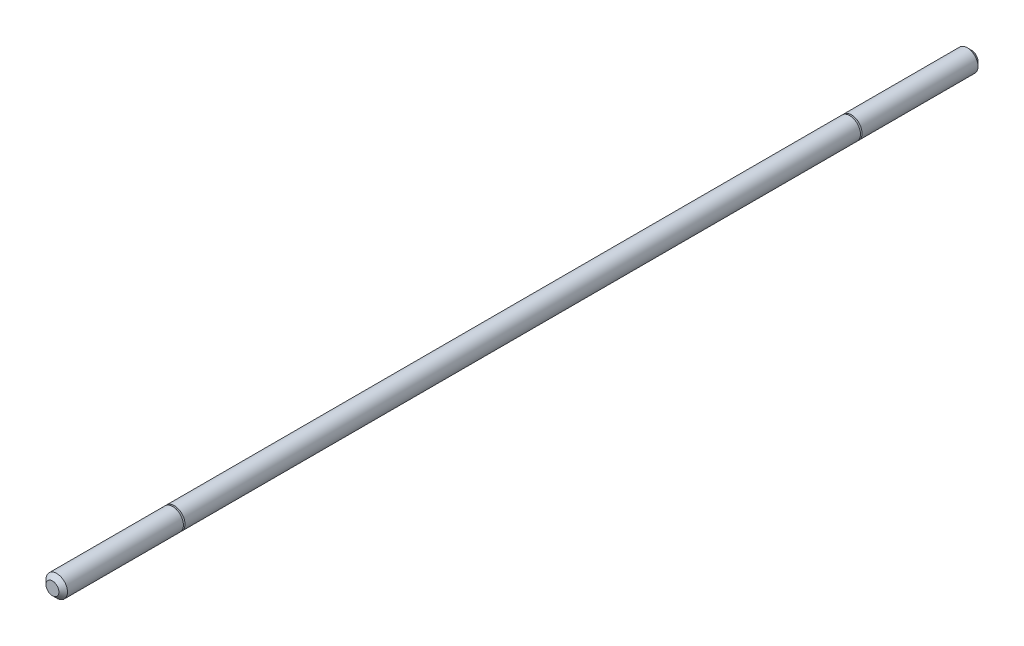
ISO-10303-21;
HEADER;
FILE_DESCRIPTION(('STEP AP214'),'2;1');
FILE_NAME('part.step','',(''),(''),'','','');
FILE_SCHEMA(('AUTOMOTIVE_DESIGN { 1 0 10303 214 1 1 1 1 }'));
ENDSEC;
DATA;
#1=APPLICATION_CONTEXT('core data for automotive mechanical design processes');
#2=APPLICATION_PROTOCOL_DEFINITION('international standard','automotive_design',2000,#1);
#3=PRODUCT_CONTEXT('',#1,'mechanical');
#4=PRODUCT('Part','Part','',(#3));
#5=PRODUCT_RELATED_PRODUCT_CATEGORY('part','',(#4));
#6=PRODUCT_DEFINITION_FORMATION('','',#4);
#7=PRODUCT_DEFINITION_CONTEXT('part definition',#1,'design');
#8=PRODUCT_DEFINITION('design','',#6,#7);
#9=PRODUCT_DEFINITION_SHAPE('','',#8);
#10=(LENGTH_UNIT() NAMED_UNIT(*) SI_UNIT(.MILLI.,.METRE.));
#11=(NAMED_UNIT(*) PLANE_ANGLE_UNIT() SI_UNIT($,.RADIAN.));
#12=(NAMED_UNIT(*) SI_UNIT($,.STERADIAN.) SOLID_ANGLE_UNIT());
#13=UNCERTAINTY_MEASURE_WITH_UNIT(LENGTH_MEASURE(1.E-05),#10,'distance_accuracy_value','');
#14=(GEOMETRIC_REPRESENTATION_CONTEXT(3) GLOBAL_UNCERTAINTY_ASSIGNED_CONTEXT((#13)) GLOBAL_UNIT_ASSIGNED_CONTEXT((#10,
#11,#12)) REPRESENTATION_CONTEXT('',''));
#15=CARTESIAN_POINT('',(0.,0.,0.));
#16=DIRECTION('',(0.,0.,1.));
#17=DIRECTION('',(1.,0.,0.));
#18=AXIS2_PLACEMENT_3D('',#15,#16,#17);
#19=CARTESIAN_POINT('',(0.,0.,339.725));
#20=DIRECTION('',(0.,0.,-1.));
#21=DIRECTION('',(-1.,0.,0.));
#22=AXIS2_PLACEMENT_3D('',#19,#20,#21);
#23=CYLINDRICAL_SURFACE('',#22,7.9375);
#24=CARTESIAN_POINT('',(0.,0.,249.6566));
#25=DIRECTION('',(0.,0.,1.));
#26=DIRECTION('',(1.,0.,0.));
#27=AXIS2_PLACEMENT_3D('',#24,#25,#26);
#28=CIRCLE('',#27,7.9375);
#29=CARTESIAN_POINT('',(7.9375,0.,249.6566));
#30=VERTEX_POINT('',#29);
#31=EDGE_CURVE('E56',#30,#30,#28,.T.);
#32=ORIENTED_EDGE('',*,*,#31,.F.);
#33=EDGE_LOOP('',(#32));
#34=FACE_BOUND('',#33,.T.);
#35=CARTESIAN_POINT('',(0.,0.,-249.6566));
#36=DIRECTION('',(0.,0.,-1.));
#37=DIRECTION('',(-1.,0.,0.));
#38=AXIS2_PLACEMENT_3D('',#35,#36,#37);
#39=CIRCLE('',#38,7.9375);
#40=CARTESIAN_POINT('',(-7.9375,0.,-249.6566));
#41=VERTEX_POINT('',#40);
#42=EDGE_CURVE('E40',#41,#41,#39,.T.);
#43=ORIENTED_EDGE('',*,*,#42,.F.);
#44=EDGE_LOOP('',(#43));
#45=FACE_BOUND('',#44,.T.);
#46=ADVANCED_FACE('F36',(#34,#45),#23,.T.);
#47=CARTESIAN_POINT('',(0.,0.,249.6566));
#48=DIRECTION('',(0.,0.,1.));
#49=DIRECTION('',(1.,0.,0.));
#50=AXIS2_PLACEMENT_3D('',#47,#48,#49);
#51=PLANE('',#50);
#52=CARTESIAN_POINT('',(0.,0.,249.6566));
#53=DIRECTION('',(0.,0.,1.));
#54=DIRECTION('',(1.,0.,0.));
#55=AXIS2_PLACEMENT_3D('',#52,#53,#54);
#56=CIRCLE('',#55,6.1595);
#57=CARTESIAN_POINT('',(6.1595,0.,249.6566));
#58=VERTEX_POINT('',#57);
#59=EDGE_CURVE('E57',#58,#58,#56,.T.);
#60=ORIENTED_EDGE('',*,*,#59,.F.);
#61=EDGE_LOOP('',(#60));
#62=FACE_BOUND('',#61,.T.);
#63=ORIENTED_EDGE('',*,*,#31,.T.);
#64=EDGE_LOOP('',(#63));
#65=FACE_BOUND('',#64,.T.);
#66=ADVANCED_FACE('F100',(#62,#65),#51,.T.);
#67=CARTESIAN_POINT('',(0.,0.,250.825));
#68=DIRECTION('',(0.,0.,1.));
#69=DIRECTION('',(1.,0.,0.));
#70=AXIS2_PLACEMENT_3D('',#67,#68,#69);
#71=PLANE('',#70);
#72=CARTESIAN_POINT('',(0.,0.,250.825));
#73=DIRECTION('',(0.,0.,1.));
#74=DIRECTION('',(1.,0.,0.));
#75=AXIS2_PLACEMENT_3D('',#72,#73,#74);
#76=CIRCLE('',#75,6.1595);
#77=CARTESIAN_POINT('',(6.1595,0.,250.825));
#78=VERTEX_POINT('',#77);
#79=EDGE_CURVE('E66',#78,#78,#76,.T.);
#80=ORIENTED_EDGE('',*,*,#79,.T.);
#81=EDGE_LOOP('',(#80));
#82=FACE_BOUND('',#81,.T.);
#83=CARTESIAN_POINT('',(0.,0.,250.825));
#84=DIRECTION('',(0.,0.,1.));
#85=DIRECTION('',(1.,0.,0.));
#86=AXIS2_PLACEMENT_3D('',#83,#84,#85);
#87=CIRCLE('',#86,7.9375);
#88=CARTESIAN_POINT('',(7.9375,0.,250.825));
#89=VERTEX_POINT('',#88);
#90=EDGE_CURVE('E53',#89,#89,#87,.T.);
#91=ORIENTED_EDGE('',*,*,#90,.F.);
#92=EDGE_LOOP('',(#91));
#93=FACE_BOUND('',#92,.T.);
#94=ADVANCED_FACE('F105',(#82,#93),#71,.F.);
#95=CARTESIAN_POINT('',(0.,0.,249.6566));
#96=DIRECTION('',(0.,0.,1.));
#97=DIRECTION('',(1.,0.,0.));
#98=AXIS2_PLACEMENT_3D('',#95,#96,#97);
#99=CYLINDRICAL_SURFACE('',#98,6.1595);
#100=ORIENTED_EDGE('',*,*,#59,.T.);
#101=EDGE_LOOP('',(#100));
#102=FACE_BOUND('',#101,.T.);
#103=ORIENTED_EDGE('',*,*,#79,.F.);
#104=EDGE_LOOP('',(#103));
#105=FACE_BOUND('',#104,.T.);
#106=ADVANCED_FACE('F127',(#102,#105),#99,.T.);
#107=CARTESIAN_POINT('',(0.,0.,339.725));
#108=DIRECTION('',(0.,0.,1.));
#109=DIRECTION('',(1.,0.,0.));
#110=AXIS2_PLACEMENT_3D('',#107,#108,#109);
#111=PLANE('',#110);
#112=CARTESIAN_POINT('',(0.,0.,339.725));
#113=DIRECTION('',(0.,0.,1.));
#114=DIRECTION('',(1.,0.,0.));
#115=AXIS2_PLACEMENT_3D('',#112,#113,#114);
#116=CIRCLE('',#115,4.76250000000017);
#117=CARTESIAN_POINT('',(4.76250000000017,0.,339.725));
#118=VERTEX_POINT('',#117);
#119=EDGE_CURVE('E11',#118,#118,#116,.T.);
#120=ORIENTED_EDGE('',*,*,#119,.T.);
#121=EDGE_LOOP('',(#120));
#122=FACE_BOUND('',#121,.T.);
#123=ADVANCED_FACE('F119',(#122),#111,.T.);
#124=CARTESIAN_POINT('',(0.,0.,339.725));
#125=DIRECTION('',(0.,0.,-1.));
#126=DIRECTION('',(-1.,0.,0.));
#127=AXIS2_PLACEMENT_3D('',#124,#125,#126);
#128=CONICAL_SURFACE('',#127,4.76250000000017,0.785398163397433);
#129=CARTESIAN_POINT('',(0.,0.,336.55));
#130=DIRECTION('',(0.,0.,1.));
#131=DIRECTION('',(1.,0.,0.));
#132=AXIS2_PLACEMENT_3D('',#129,#130,#131);
#133=CIRCLE('',#132,7.9375);
#134=CARTESIAN_POINT('',(7.9375,0.,336.55));
#135=VERTEX_POINT('',#134);
#136=EDGE_CURVE('E59',#135,#135,#133,.F.);
#137=ORIENTED_EDGE('',*,*,#136,.F.);
#138=EDGE_LOOP('',(#137));
#139=FACE_BOUND('',#138,.T.);
#140=ORIENTED_EDGE('',*,*,#119,.F.);
#141=EDGE_LOOP('',(#140));
#142=FACE_BOUND('',#141,.T.);
#143=ADVANCED_FACE('F38',(#139,#142),#128,.T.);
#144=ORIENTED_EDGE('',*,*,#90,.T.);
#145=EDGE_LOOP('',(#144));
#146=FACE_BOUND('',#145,.T.);
#147=ORIENTED_EDGE('',*,*,#136,.T.);
#148=EDGE_LOOP('',(#147));
#149=FACE_BOUND('',#148,.T.);
#150=ADVANCED_FACE('F94',(#146,#149),#23,.T.);
#151=CARTESIAN_POINT('',(0.,0.,-249.6566));
#152=DIRECTION('',(0.,0.,-1.));
#153=DIRECTION('',(-1.,0.,0.));
#154=AXIS2_PLACEMENT_3D('',#151,#152,#153);
#155=PLANE('',#154);
#156=CARTESIAN_POINT('',(0.,0.,-249.6566));
#157=DIRECTION('',(0.,0.,1.));
#158=DIRECTION('',(1.,0.,0.));
#159=AXIS2_PLACEMENT_3D('',#156,#157,#158);
#160=CIRCLE('',#159,6.1595);
#161=CARTESIAN_POINT('',(6.1595,0.,-249.6566));
#162=VERTEX_POINT('',#161);
#163=EDGE_CURVE('E62',#162,#162,#160,.T.);
#164=ORIENTED_EDGE('',*,*,#163,.T.);
#165=EDGE_LOOP('',(#164));
#166=FACE_BOUND('',#165,.T.);
#167=ORIENTED_EDGE('',*,*,#42,.T.);
#168=EDGE_LOOP('',(#167));
#169=FACE_BOUND('',#168,.T.);
#170=ADVANCED_FACE('F111',(#166,#169),#155,.T.);
#171=CARTESIAN_POINT('',(0.,0.,-250.825));
#172=DIRECTION('',(0.,0.,-1.));
#173=DIRECTION('',(-1.,0.,0.));
#174=AXIS2_PLACEMENT_3D('',#171,#172,#173);
#175=PLANE('',#174);
#176=CARTESIAN_POINT('',(0.,0.,-250.825));
#177=DIRECTION('',(0.,0.,1.));
#178=DIRECTION('',(1.,0.,0.));
#179=AXIS2_PLACEMENT_3D('',#176,#177,#178);
#180=CIRCLE('',#179,6.1595);
#181=CARTESIAN_POINT('',(6.1595,0.,-250.825));
#182=VERTEX_POINT('',#181);
#183=EDGE_CURVE('E68',#182,#182,#180,.T.);
#184=ORIENTED_EDGE('',*,*,#183,.F.);
#185=EDGE_LOOP('',(#184));
#186=FACE_BOUND('',#185,.T.);
#187=CARTESIAN_POINT('',(0.,0.,-250.825));
#188=DIRECTION('',(0.,0.,-1.));
#189=DIRECTION('',(-1.,0.,0.));
#190=AXIS2_PLACEMENT_3D('',#187,#188,#189);
#191=CIRCLE('',#190,7.9375);
#192=CARTESIAN_POINT('',(-7.9375,0.,-250.825));
#193=VERTEX_POINT('',#192);
#194=EDGE_CURVE('E60',#193,#193,#191,.T.);
#195=ORIENTED_EDGE('',*,*,#194,.F.);
#196=EDGE_LOOP('',(#195));
#197=FACE_BOUND('',#196,.T.);
#198=ADVANCED_FACE('F117',(#186,#197),#175,.F.);
#199=CARTESIAN_POINT('',(0.,0.,-249.6566));
#200=DIRECTION('',(0.,0.,-1.));
#201=DIRECTION('',(-1.,0.,0.));
#202=AXIS2_PLACEMENT_3D('',#199,#200,#201);
#203=CYLINDRICAL_SURFACE('',#202,6.1595);
#204=ORIENTED_EDGE('',*,*,#163,.F.);
#205=EDGE_LOOP('',(#204));
#206=FACE_BOUND('',#205,.T.);
#207=ORIENTED_EDGE('',*,*,#183,.T.);
#208=EDGE_LOOP('',(#207));
#209=FACE_BOUND('',#208,.T.);
#210=ADVANCED_FACE('F95',(#206,#209),#203,.T.);
#211=CARTESIAN_POINT('',(0.,0.,-339.725));
#212=DIRECTION('',(0.,0.,1.));
#213=DIRECTION('',(1.,0.,0.));
#214=AXIS2_PLACEMENT_3D('',#211,#212,#213);
#215=PLANE('',#214);
#216=CARTESIAN_POINT('',(0.,0.,-339.725));
#217=DIRECTION('',(0.,0.,1.));
#218=DIRECTION('',(1.,0.,0.));
#219=AXIS2_PLACEMENT_3D('',#216,#217,#218);
#220=CIRCLE('',#219,4.76249999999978);
#221=CARTESIAN_POINT('',(4.76249999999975,0.,-339.725));
#222=VERTEX_POINT('',#221);
#223=EDGE_CURVE('E44',#222,#222,#220,.F.);
#224=ORIENTED_EDGE('',*,*,#223,.T.);
#225=EDGE_LOOP('',(#224));
#226=FACE_BOUND('',#225,.T.);
#227=ADVANCED_FACE('F87',(#226),#215,.F.);
#228=CARTESIAN_POINT('',(0.,0.,-336.55));
#229=DIRECTION('',(0.,0.,1.));
#230=DIRECTION('',(1.,0.,0.));
#231=AXIS2_PLACEMENT_3D('',#228,#229,#230);
#232=CONICAL_SURFACE('',#231,7.9375,0.785398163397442);
#233=CARTESIAN_POINT('',(0.,0.,-336.55));
#234=DIRECTION('',(0.,0.,1.));
#235=DIRECTION('',(1.,0.,0.));
#236=AXIS2_PLACEMENT_3D('',#233,#234,#235);
#237=CIRCLE('',#236,7.9375);
#238=CARTESIAN_POINT('',(7.93749999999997,0.,-336.55));
#239=VERTEX_POINT('',#238);
#240=EDGE_CURVE('E49',#239,#239,#237,.T.);
#241=CARTESIAN_POINT('',(4.76249999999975,0.,-339.725));
#242=CARTESIAN_POINT('',(4.79557291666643,0.,-339.691927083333));
#243=CARTESIAN_POINT('',(4.8286458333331,0.,-339.658854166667));
#244=CARTESIAN_POINT('',(4.89479166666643,0.,-339.592708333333));
#245=CARTESIAN_POINT('',(4.9278645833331,0.,-339.559635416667));
#246=CARTESIAN_POINT('',(4.99401041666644,0.,-339.493489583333));
#247=CARTESIAN_POINT('',(5.02708333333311,0.,-339.460416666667));
#248=CARTESIAN_POINT('',(5.09322916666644,0.,-339.394270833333));
#249=CARTESIAN_POINT('',(5.12630208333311,0.,-339.361197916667));
#250=CARTESIAN_POINT('',(5.19244791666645,0.,-339.295052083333));
#251=CARTESIAN_POINT('',(5.22552083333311,0.,-339.261979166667));
#252=CARTESIAN_POINT('',(5.29166666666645,0.,-339.195833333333));
#253=CARTESIAN_POINT('',(5.32473958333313,0.,-339.162760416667));
#254=CARTESIAN_POINT('',(5.39088541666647,0.,-339.096614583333));
#255=CARTESIAN_POINT('',(5.42395833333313,0.,-339.063541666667));
#256=CARTESIAN_POINT('',(5.49010416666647,0.,-338.997395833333));
#257=CARTESIAN_POINT('',(5.52317708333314,0.,-338.964322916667));
#258=CARTESIAN_POINT('',(5.58932291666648,0.,-338.898177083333));
#259=CARTESIAN_POINT('',(5.62239583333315,0.,-338.865104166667));
#260=CARTESIAN_POINT('',(5.68854166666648,0.,-338.798958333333));
#261=CARTESIAN_POINT('',(5.72161458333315,0.,-338.765885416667));
#262=CARTESIAN_POINT('',(5.78776041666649,0.,-338.699739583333));
#263=CARTESIAN_POINT('',(5.82083333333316,0.,-338.666666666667));
#264=CARTESIAN_POINT('',(5.8869791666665,0.,-338.600520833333));
#265=CARTESIAN_POINT('',(5.92005208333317,0.,-338.567447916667));
#266=CARTESIAN_POINT('',(5.9861979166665,0.,-338.501302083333));
#267=CARTESIAN_POINT('',(6.01927083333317,0.,-338.468229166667));
#268=CARTESIAN_POINT('',(6.08541666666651,0.,-338.402083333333));
#269=CARTESIAN_POINT('',(6.11848958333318,0.,-338.369010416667));
#270=CARTESIAN_POINT('',(6.18463541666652,0.,-338.302864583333));
#271=CARTESIAN_POINT('',(6.21770833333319,0.,-338.269791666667));
#272=CARTESIAN_POINT('',(6.28385416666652,0.,-338.203645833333));
#273=CARTESIAN_POINT('',(6.31692708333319,0.,-338.170572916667));
#274=CARTESIAN_POINT('',(6.38307291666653,0.,-338.104427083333));
#275=CARTESIAN_POINT('',(6.4161458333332,0.,-338.071354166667));
#276=CARTESIAN_POINT('',(6.48229166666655,0.,-338.005208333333));
#277=CARTESIAN_POINT('',(6.51536458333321,0.,-337.972135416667));
#278=CARTESIAN_POINT('',(6.58151041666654,0.,-337.905989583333));
#279=CARTESIAN_POINT('',(6.61458333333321,0.,-337.872916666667));
#280=CARTESIAN_POINT('',(6.68072916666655,0.,-337.806770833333));
#281=CARTESIAN_POINT('',(6.71380208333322,0.,-337.773697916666));
#282=CARTESIAN_POINT('',(6.77994791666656,0.,-337.707552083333));
#283=CARTESIAN_POINT('',(6.81302083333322,0.,-337.674479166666));
#284=CARTESIAN_POINT('',(6.87916666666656,0.,-337.608333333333));
#285=CARTESIAN_POINT('',(6.91223958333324,0.,-337.575260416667));
#286=CARTESIAN_POINT('',(6.97838541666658,0.,-337.509114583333));
#287=CARTESIAN_POINT('',(7.01145833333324,0.,-337.476041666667));
#288=CARTESIAN_POINT('',(7.07760416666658,0.,-337.409895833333));
#289=CARTESIAN_POINT('',(7.11067708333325,0.,-337.376822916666));
#290=CARTESIAN_POINT('',(7.17682291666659,0.,-337.310677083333));
#291=CARTESIAN_POINT('',(7.20989583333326,0.,-337.277604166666));
#292=CARTESIAN_POINT('',(7.27604166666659,0.,-337.211458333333));
#293=CARTESIAN_POINT('',(7.30911458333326,0.,-337.178385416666));
#294=CARTESIAN_POINT('',(7.3752604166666,0.,-337.112239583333));
#295=CARTESIAN_POINT('',(7.40833333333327,0.,-337.079166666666));
#296=CARTESIAN_POINT('',(7.47447916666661,0.,-337.013020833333));
#297=CARTESIAN_POINT('',(7.50755208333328,0.,-336.979947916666));
#298=CARTESIAN_POINT('',(7.57369791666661,0.,-336.913802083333));
#299=CARTESIAN_POINT('',(7.60677083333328,0.,-336.880729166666));
#300=CARTESIAN_POINT('',(7.67291666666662,0.,-336.814583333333));
#301=CARTESIAN_POINT('',(7.70598958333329,0.,-336.781510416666));
#302=CARTESIAN_POINT('',(7.77213541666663,0.,-336.715364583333));
#303=CARTESIAN_POINT('',(7.8052083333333,0.,-336.682291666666));
#304=CARTESIAN_POINT('',(7.87135416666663,0.,-336.616145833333));
#305=CARTESIAN_POINT('',(7.9044270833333,0.,-336.583072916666));
#306=CARTESIAN_POINT('',(7.93749999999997,0.,-336.55));
#307=B_SPLINE_CURVE_WITH_KNOTS('',3,(#241,#242,#243,#244,#245,#246,#247,#248,#249,#250,#251,
#252,#253,#254,#255,#256,#257,#258,#259,#260,#261,#262,#263,#264,#265,#266,#267,#268,#269,#270,
#271,#272,#273,#274,#275,#276,#277,#278,#279,#280,#281,#282,#283,#284,#285,#286,#287,#288,#289,
#290,#291,#292,#293,#294,#295,#296,#297,#298,#299,#300,#301,#302,#303,#304,#305,#306),
.UNSPECIFIED.,.F.,.F.,(4,2,2,2,2,2,2,2,2,2,2,2,2,2,2,2,2,2,2,2,2,2,2,2,2,2,2,2,2,2,2,2,4),(0.,
0.140316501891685,0.280633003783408,0.420949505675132,0.561266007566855,0.701582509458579,
0.841899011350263,0.982215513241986,1.12253201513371,1.26284851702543,1.40316501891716,
1.54348152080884,1.68379802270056,1.82411452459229,1.96443102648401,2.10474752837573,
2.24506403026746,2.38538053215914,2.52569703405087,2.66601353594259,2.80633003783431,
2.94664653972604,3.08696304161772,3.22727954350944,3.36759604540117,3.50791254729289,
3.64822904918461,3.7885455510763,3.92886205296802,4.06917855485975,4.20949505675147,
4.34981155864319,4.49012806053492),.UNSPECIFIED.);
#308=EDGE_CURVE('BSEAM85',#222,#239,#307,.T.);
#309=ORIENTED_EDGE('',*,*,#223,.F.);
#310=ORIENTED_EDGE('',*,*,#240,.F.);
#311=ORIENTED_EDGE('',*,*,#308,.T.);
#312=ORIENTED_EDGE('',*,*,#308,.F.);
#313=EDGE_LOOP('',(#309,#311,#310,#312));
#314=FACE_BOUND('',#313,.T.);
#315=ADVANCED_FACE('F85',(#314),#232,.T.);
#316=ORIENTED_EDGE('',*,*,#194,.T.);
#317=EDGE_LOOP('',(#316));
#318=FACE_BOUND('',#317,.T.);
#319=ORIENTED_EDGE('',*,*,#240,.T.);
#320=EDGE_LOOP('',(#319));
#321=FACE_BOUND('',#320,.T.);
#322=ADVANCED_FACE('F83',(#318,#321),#23,.T.);
#323=CLOSED_SHELL('',(#46,#66,#94,#106,#123,#143,#150,#170,#198,#210,#227,#315,#322));
#324=MANIFOLD_SOLID_BREP('B2',#323);
#325=ADVANCED_BREP_SHAPE_REPRESENTATION('',(#18,#324),#14);
#326=SHAPE_DEFINITION_REPRESENTATION(#9,#325);
ENDSEC;
END-ISO-10303-21;
